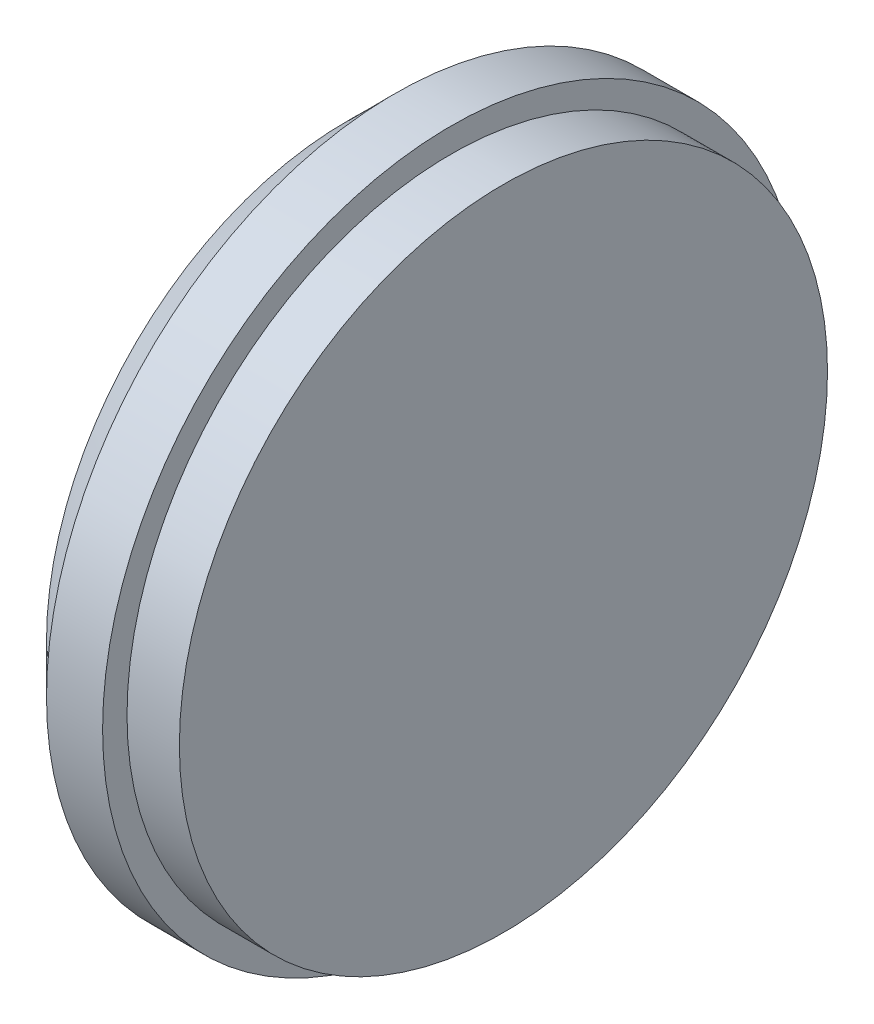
from build123d import *


with BuildPart() as part:
    # Sketch1 → Revolve1 (revolve)
    with BuildSketch(Plane.XY, mode=Mode.PRIVATE) as revolve1_sk:
        Polygon((-6.34746, 31.34106), (-6.34746, -3.05054), (-11.90498, -3.05054), (-11.90498, -5.64134), (-17.85874, -5.64134), (-23.01748, -0.4826), (-23.01748, 31.34106), align=None)
    revolve(revolve1_sk.sketch.rotate(Axis((-23.01748, 31.34106, 0), (1, 0, 0)), 270), axis=Axis((-23.01748, 31.34106, 0), (1, 0, 0)))


solid = part.part
